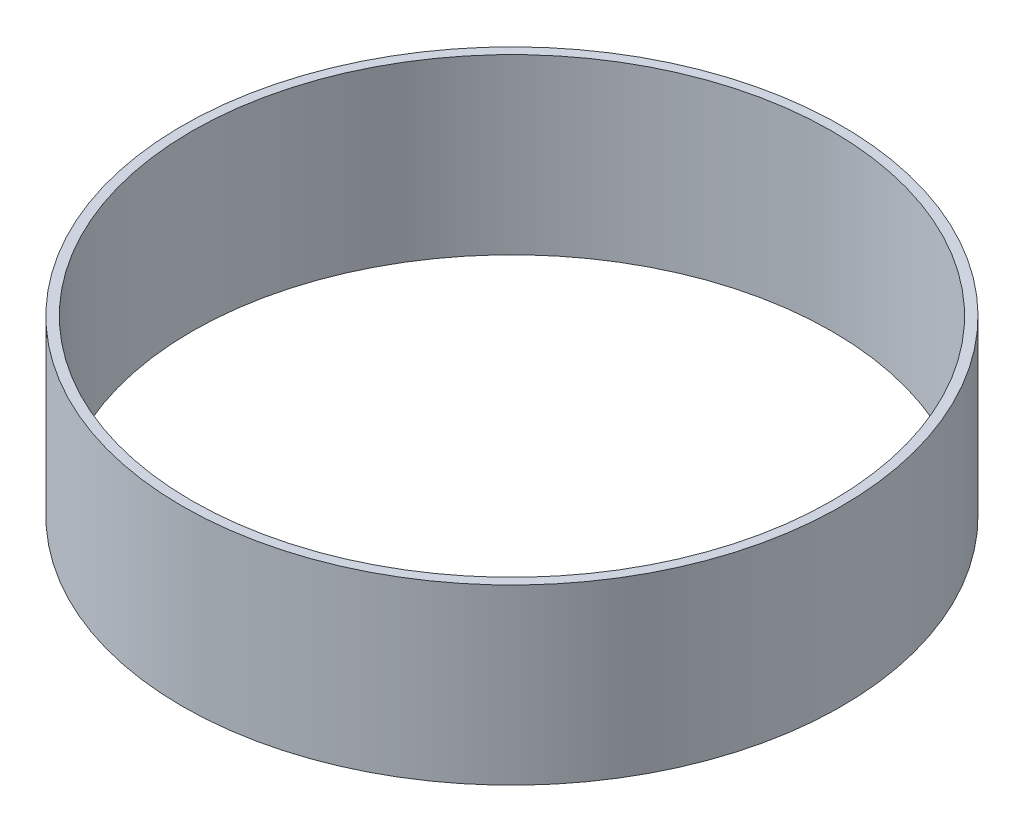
ISO-10303-21;
HEADER;
FILE_DESCRIPTION(('STEP AP214'),'2;1');
FILE_NAME('part.step','',(''),(''),'','','');
FILE_SCHEMA(('AUTOMOTIVE_DESIGN { 1 0 10303 214 1 1 1 1 }'));
ENDSEC;
DATA;
#1=APPLICATION_CONTEXT('core data for automotive mechanical design processes');
#2=APPLICATION_PROTOCOL_DEFINITION('international standard','automotive_design',2000,#1);
#3=PRODUCT_CONTEXT('',#1,'mechanical');
#4=PRODUCT('Part','Part','',(#3));
#5=PRODUCT_RELATED_PRODUCT_CATEGORY('part','',(#4));
#6=PRODUCT_DEFINITION_FORMATION('','',#4);
#7=PRODUCT_DEFINITION_CONTEXT('part definition',#1,'design');
#8=PRODUCT_DEFINITION('design','',#6,#7);
#9=PRODUCT_DEFINITION_SHAPE('','',#8);
#10=(LENGTH_UNIT() NAMED_UNIT(*) SI_UNIT(.MILLI.,.METRE.));
#11=(NAMED_UNIT(*) PLANE_ANGLE_UNIT() SI_UNIT($,.RADIAN.));
#12=(NAMED_UNIT(*) SI_UNIT($,.STERADIAN.) SOLID_ANGLE_UNIT());
#13=UNCERTAINTY_MEASURE_WITH_UNIT(LENGTH_MEASURE(1.E-05),#10,'distance_accuracy_value','');
#14=(GEOMETRIC_REPRESENTATION_CONTEXT(3) GLOBAL_UNCERTAINTY_ASSIGNED_CONTEXT((#13)) GLOBAL_UNIT_ASSIGNED_CONTEXT((#10,
#11,#12)) REPRESENTATION_CONTEXT('',''));
#15=CARTESIAN_POINT('',(0.,0.,0.));
#16=DIRECTION('',(0.,0.,1.));
#17=DIRECTION('',(1.,0.,0.));
#18=AXIS2_PLACEMENT_3D('',#15,#16,#17);
#19=CARTESIAN_POINT('',(0.,17.36,0.));
#20=DIRECTION('',(0.,1.,0.));
#21=DIRECTION('',(0.,0.,1.));
#22=AXIS2_PLACEMENT_3D('',#19,#20,#21);
#23=PLANE('',#22);
#24=CARTESIAN_POINT('',(0.,17.36,0.));
#25=DIRECTION('',(0.,1.,0.));
#26=DIRECTION('',(0.,0.,1.));
#27=AXIS2_PLACEMENT_3D('',#24,#25,#26);
#28=CIRCLE('',#27,33.);
#29=CARTESIAN_POINT('',(0.,17.36,33.));
#30=VERTEX_POINT('',#29);
#31=EDGE_CURVE('E10',#30,#30,#28,.T.);
#32=ORIENTED_EDGE('',*,*,#31,.T.);
#33=EDGE_LOOP('',(#32));
#34=FACE_BOUND('',#33,.T.);
#35=CARTESIAN_POINT('',(0.,17.36,0.));
#36=DIRECTION('',(0.,1.,0.));
#37=DIRECTION('',(0.,0.,1.));
#38=AXIS2_PLACEMENT_3D('',#35,#36,#37);
#39=CIRCLE('',#38,32.05);
#40=CARTESIAN_POINT('',(0.,17.36,32.05));
#41=VERTEX_POINT('',#40);
#42=EDGE_CURVE('E52',#41,#41,#39,.T.);
#43=ORIENTED_EDGE('',*,*,#42,.F.);
#44=EDGE_LOOP('',(#43));
#45=FACE_BOUND('',#44,.T.);
#46=ADVANCED_FACE('F39',(#34,#45),#23,.T.);
#47=CARTESIAN_POINT('',(0.,0.,0.));
#48=DIRECTION('',(0.,1.,0.));
#49=DIRECTION('',(0.,0.,1.));
#50=AXIS2_PLACEMENT_3D('',#47,#48,#49);
#51=PLANE('',#50);
#52=CARTESIAN_POINT('',(0.,0.,0.));
#53=DIRECTION('',(0.,1.,0.));
#54=DIRECTION('',(0.,0.,1.));
#55=AXIS2_PLACEMENT_3D('',#52,#53,#54);
#56=CIRCLE('',#55,33.);
#57=CARTESIAN_POINT('',(0.,0.,33.));
#58=VERTEX_POINT('',#57);
#59=EDGE_CURVE('E43',#58,#58,#56,.T.);
#60=ORIENTED_EDGE('',*,*,#59,.F.);
#61=EDGE_LOOP('',(#60));
#62=FACE_BOUND('',#61,.T.);
#63=CARTESIAN_POINT('',(0.,0.,0.));
#64=DIRECTION('',(0.,1.,0.));
#65=DIRECTION('',(0.,0.,1.));
#66=AXIS2_PLACEMENT_3D('',#63,#64,#65);
#67=CIRCLE('',#66,32.05);
#68=CARTESIAN_POINT('',(0.,0.,32.05));
#69=VERTEX_POINT('',#68);
#70=EDGE_CURVE('E54',#69,#69,#67,.T.);
#71=ORIENTED_EDGE('',*,*,#70,.T.);
#72=EDGE_LOOP('',(#71));
#73=FACE_BOUND('',#72,.T.);
#74=ADVANCED_FACE('F66',(#62,#73),#51,.F.);
#75=CARTESIAN_POINT('',(0.,17.36,0.));
#76=DIRECTION('',(0.,-1.,0.));
#77=DIRECTION('',(0.,0.,-1.));
#78=AXIS2_PLACEMENT_3D('',#75,#76,#77);
#79=CYLINDRICAL_SURFACE('',#78,33.);
#80=ORIENTED_EDGE('',*,*,#31,.F.);
#81=EDGE_LOOP('',(#80));
#82=FACE_BOUND('',#81,.T.);
#83=ORIENTED_EDGE('',*,*,#59,.T.);
#84=EDGE_LOOP('',(#83));
#85=FACE_BOUND('',#84,.T.);
#86=ADVANCED_FACE('F41',(#82,#85),#79,.T.);
#87=CARTESIAN_POINT('',(0.,17.36,0.));
#88=DIRECTION('',(0.,-1.,0.));
#89=DIRECTION('',(0.,0.,-1.));
#90=AXIS2_PLACEMENT_3D('',#87,#88,#89);
#91=CYLINDRICAL_SURFACE('',#90,32.05);
#92=ORIENTED_EDGE('',*,*,#42,.T.);
#93=EDGE_LOOP('',(#92));
#94=FACE_BOUND('',#93,.T.);
#95=ORIENTED_EDGE('',*,*,#70,.F.);
#96=EDGE_LOOP('',(#95));
#97=FACE_BOUND('',#96,.T.);
#98=ADVANCED_FACE('F62',(#94,#97),#91,.F.);
#99=CLOSED_SHELL('',(#46,#74,#86,#98));
#100=MANIFOLD_SOLID_BREP('B2',#99);
#101=ADVANCED_BREP_SHAPE_REPRESENTATION('',(#18,#100),#14);
#102=SHAPE_DEFINITION_REPRESENTATION(#9,#101);
ENDSEC;
END-ISO-10303-21;
